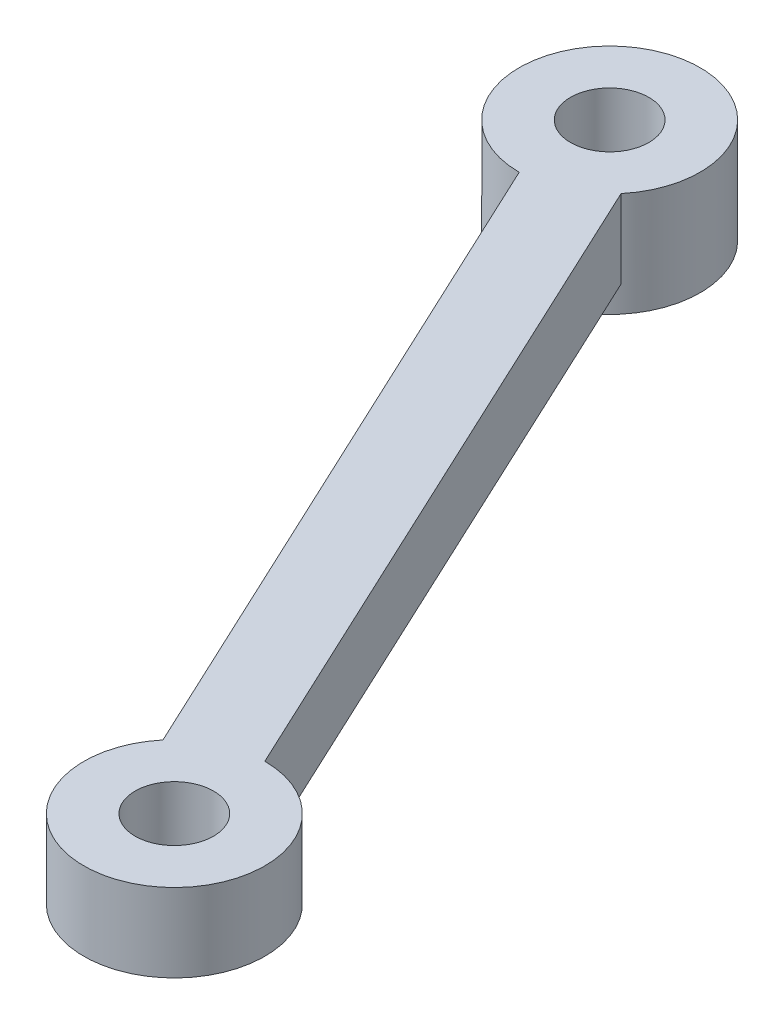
ISO-10303-21;
HEADER;
FILE_DESCRIPTION(('STEP AP214'),'2;1');
FILE_NAME('part.step','',(''),(''),'','','');
FILE_SCHEMA(('AUTOMOTIVE_DESIGN { 1 0 10303 214 1 1 1 1 }'));
ENDSEC;
DATA;
#1=APPLICATION_CONTEXT('core data for automotive mechanical design processes');
#2=APPLICATION_PROTOCOL_DEFINITION('international standard','automotive_design',2000,#1);
#3=PRODUCT_CONTEXT('',#1,'mechanical');
#4=PRODUCT('Part','Part','',(#3));
#5=PRODUCT_RELATED_PRODUCT_CATEGORY('part','',(#4));
#6=PRODUCT_DEFINITION_FORMATION('','',#4);
#7=PRODUCT_DEFINITION_CONTEXT('part definition',#1,'design');
#8=PRODUCT_DEFINITION('design','',#6,#7);
#9=PRODUCT_DEFINITION_SHAPE('','',#8);
#10=(LENGTH_UNIT() NAMED_UNIT(*) SI_UNIT(.MILLI.,.METRE.));
#11=(NAMED_UNIT(*) PLANE_ANGLE_UNIT() SI_UNIT($,.RADIAN.));
#12=(NAMED_UNIT(*) SI_UNIT($,.STERADIAN.) SOLID_ANGLE_UNIT());
#13=UNCERTAINTY_MEASURE_WITH_UNIT(LENGTH_MEASURE(1.E-05),#10,'distance_accuracy_value','');
#14=(GEOMETRIC_REPRESENTATION_CONTEXT(3) GLOBAL_UNCERTAINTY_ASSIGNED_CONTEXT((#13)) GLOBAL_UNIT_ASSIGNED_CONTEXT((#10,
#11,#12)) REPRESENTATION_CONTEXT('',''));
#15=CARTESIAN_POINT('',(0.,0.,0.));
#16=DIRECTION('',(0.,0.,1.));
#17=DIRECTION('',(1.,0.,0.));
#18=AXIS2_PLACEMENT_3D('',#15,#16,#17);
#19=CARTESIAN_POINT('',(0.,27.,-88.));
#20=DIRECTION('',(0.,-1.,0.));
#21=DIRECTION('',(-0.423940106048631,0.,-0.905690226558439));
#22=AXIS2_PLACEMENT_3D('',#19,#20,#21);
#23=PLANE('',#22);
#24=CARTESIAN_POINT('',(22.,27.,-41.));
#25=DIRECTION('',(0.,-1.,0.));
#26=DIRECTION('',(0.,0.,-1.));
#27=AXIS2_PLACEMENT_3D('',#24,#25,#26);
#28=CIRCLE('',#27,2.25);
#29=CARTESIAN_POINT('',(22.,27.,-43.25));
#30=VERTEX_POINT('',#29);
#31=EDGE_CURVE('E96',#30,#30,#28,.T.);
#32=ORIENTED_EDGE('',*,*,#31,.F.);
#33=EDGE_LOOP('',(#32));
#34=FACE_BOUND('',#33,.T.);
#35=DIRECTION('',(0.423940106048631,0.,0.905690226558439));
#36=VECTOR('',#35,1.);
#37=CARTESIAN_POINT('',(1.99251849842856,27.,-88.932668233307));
#38=LINE('',#37,#36);
#39=CARTESIAN_POINT('',(3.98999183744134,27.,-84.6653388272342));
#40=VERTEX_POINT('',#39);
#41=CARTESIAN_POINT('',(21.9950451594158,27.,-46.1999976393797));
#42=VERTEX_POINT('',#41);
#43=EDGE_CURVE('E63',#40,#42,#38,.T.);
#44=ORIENTED_EDGE('',*,*,#43,.T.);
#45=CARTESIAN_POINT('',(22.,27.,-41.));
#46=DIRECTION('',(0.,1.,0.));
#47=DIRECTION('',(0.,0.,1.));
#48=AXIS2_PLACEMENT_3D('',#45,#46,#47);
#49=CIRCLE('',#48,5.2);
#50=CARTESIAN_POINT('',(18.0100081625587,27.,-44.3346611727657));
#51=VERTEX_POINT('',#50);
#52=EDGE_CURVE('E71',#51,#42,#49,.T.);
#53=ORIENTED_EDGE('',*,*,#52,.F.);
#54=DIRECTION('',(0.423940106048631,0.,0.905690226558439));
#55=VECTOR('',#54,1.);
#56=CARTESIAN_POINT('',(-1.99251849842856,27.,-87.067331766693));
#57=LINE('',#56,#55);
#58=CARTESIAN_POINT('',(0.00495484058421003,27.,-82.8000023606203));
#59=VERTEX_POINT('',#58);
#60=EDGE_CURVE('E32',#59,#51,#57,.T.);
#61=ORIENTED_EDGE('',*,*,#60,.F.);
#62=CARTESIAN_POINT('',(0.,27.,-88.));
#63=DIRECTION('',(0.,-1.,0.));
#64=DIRECTION('',(0.,0.,-1.));
#65=AXIS2_PLACEMENT_3D('',#62,#63,#64);
#66=CIRCLE('',#65,5.2);
#67=EDGE_CURVE('E83',#40,#59,#66,.T.);
#68=ORIENTED_EDGE('',*,*,#67,.F.);
#69=EDGE_LOOP('',(#44,#53,#61,#68));
#70=FACE_BOUND('',#69,.T.);
#71=ADVANCED_FACE('F16',(#34,#70),#23,.T.);
#72=CARTESIAN_POINT('',(-1.99251849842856,29.25,-87.067331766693));
#73=DIRECTION('',(-0.905690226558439,0.,0.423940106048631));
#74=DIRECTION('',(0.423940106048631,0.,0.905690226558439));
#75=AXIS2_PLACEMENT_3D('',#72,#73,#74);
#76=PLANE('',#75);
#77=DIRECTION('',(0.,1.,0.));
#78=VECTOR('',#77,1.);
#79=CARTESIAN_POINT('',(18.0100081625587,27.,-44.3346611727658));
#80=LINE('',#79,#78);
#81=CARTESIAN_POINT('',(18.0100081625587,31.5,-44.3346611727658));
#82=VERTEX_POINT('',#81);
#83=EDGE_CURVE('E38',#82,#51,#80,.F.);
#84=ORIENTED_EDGE('',*,*,#83,.F.);
#85=DIRECTION('',(0.423940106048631,0.,0.905690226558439));
#86=VECTOR('',#85,1.);
#87=CARTESIAN_POINT('',(-1.99251849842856,31.5,-87.067331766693));
#88=LINE('',#87,#86);
#89=CARTESIAN_POINT('',(0.00495484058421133,31.5,-82.8000023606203));
#90=VERTEX_POINT('',#89);
#91=EDGE_CURVE('E64',#90,#82,#88,.T.);
#92=ORIENTED_EDGE('',*,*,#91,.F.);
#93=DIRECTION('',(0.,1.,0.));
#94=VECTOR('',#93,1.);
#95=CARTESIAN_POINT('',(0.00495484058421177,25.5,-82.8000023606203));
#96=LINE('',#95,#94);
#97=EDGE_CURVE('E86',#59,#90,#96,.T.);
#98=ORIENTED_EDGE('',*,*,#97,.F.);
#99=ORIENTED_EDGE('',*,*,#60,.T.);
#100=EDGE_LOOP('',(#84,#92,#98,#99));
#101=FACE_BOUND('',#100,.T.);
#102=ADVANCED_FACE('F112',(#101),#76,.T.);
#103=CARTESIAN_POINT('',(0.,31.5,-88.));
#104=DIRECTION('',(0.,1.,0.));
#105=DIRECTION('',(0.423940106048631,0.,0.905690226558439));
#106=AXIS2_PLACEMENT_3D('',#103,#104,#105);
#107=PLANE('',#106);
#108=CARTESIAN_POINT('',(22.,31.5,-41.));
#109=DIRECTION('',(0.,1.,0.));
#110=DIRECTION('',(0.,0.,1.));
#111=AXIS2_PLACEMENT_3D('',#108,#109,#110);
#112=CIRCLE('',#111,2.25);
#113=CARTESIAN_POINT('',(22.,31.5,-38.75));
#114=VERTEX_POINT('',#113);
#115=EDGE_CURVE('E19',#114,#114,#112,.T.);
#116=ORIENTED_EDGE('',*,*,#115,.F.);
#117=EDGE_LOOP('',(#116));
#118=FACE_BOUND('',#117,.T.);
#119=CARTESIAN_POINT('',(0.,31.5,-88.));
#120=DIRECTION('',(0.,1.,0.));
#121=DIRECTION('',(0.,0.,1.));
#122=AXIS2_PLACEMENT_3D('',#119,#120,#121);
#123=CIRCLE('',#122,2.25);
#124=CARTESIAN_POINT('',(0.,31.5,-85.75));
#125=VERTEX_POINT('',#124);
#126=EDGE_CURVE('E80',#125,#125,#123,.T.);
#127=ORIENTED_EDGE('',*,*,#126,.F.);
#128=EDGE_LOOP('',(#127));
#129=FACE_BOUND('',#128,.T.);
#130=ORIENTED_EDGE('',*,*,#91,.T.);
#131=CARTESIAN_POINT('',(22.,31.5,-41.));
#132=DIRECTION('',(0.,-1.,0.));
#133=DIRECTION('',(0.,0.,-1.));
#134=AXIS2_PLACEMENT_3D('',#131,#132,#133);
#135=CIRCLE('',#134,5.2);
#136=CARTESIAN_POINT('',(21.9950451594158,31.5,-46.1999976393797));
#137=VERTEX_POINT('',#136);
#138=EDGE_CURVE('E69',#137,#82,#135,.T.);
#139=ORIENTED_EDGE('',*,*,#138,.F.);
#140=DIRECTION('',(0.423940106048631,0.,0.905690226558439));
#141=VECTOR('',#140,1.);
#142=CARTESIAN_POINT('',(1.99251849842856,31.5,-88.932668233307));
#143=LINE('',#142,#141);
#144=CARTESIAN_POINT('',(3.98999183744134,31.5,-84.6653388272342));
#145=VERTEX_POINT('',#144);
#146=EDGE_CURVE('E54',#145,#137,#143,.T.);
#147=ORIENTED_EDGE('',*,*,#146,.F.);
#148=CARTESIAN_POINT('',(0.,31.5,-88.));
#149=DIRECTION('',(0.,-1.,0.));
#150=DIRECTION('',(0.,0.,-1.));
#151=AXIS2_PLACEMENT_3D('',#148,#149,#150);
#152=CIRCLE('',#151,5.2);
#153=EDGE_CURVE('E84',#90,#145,#152,.T.);
#154=ORIENTED_EDGE('',*,*,#153,.F.);
#155=EDGE_LOOP('',(#130,#139,#147,#154));
#156=FACE_BOUND('',#155,.T.);
#157=ADVANCED_FACE('F73',(#118,#129,#156),#107,.T.);
#158=CARTESIAN_POINT('',(1.99251849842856,29.25,-88.932668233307));
#159=DIRECTION('',(0.905690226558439,0.,-0.423940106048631));
#160=DIRECTION('',(-0.423940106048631,0.,-0.905690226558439));
#161=AXIS2_PLACEMENT_3D('',#158,#159,#160);
#162=PLANE('',#161);
#163=DIRECTION('',(0.,1.,0.));
#164=VECTOR('',#163,1.);
#165=CARTESIAN_POINT('',(21.9950451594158,27.,-46.1999976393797));
#166=LINE('',#165,#164);
#167=EDGE_CURVE('E10',#42,#137,#166,.T.);
#168=ORIENTED_EDGE('',*,*,#167,.F.);
#169=ORIENTED_EDGE('',*,*,#43,.F.);
#170=DIRECTION('',(0.,1.,0.));
#171=VECTOR('',#170,1.);
#172=CARTESIAN_POINT('',(3.98999183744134,25.5,-84.6653388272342));
#173=LINE('',#172,#171);
#174=EDGE_CURVE('E24',#145,#40,#173,.F.);
#175=ORIENTED_EDGE('',*,*,#174,.F.);
#176=ORIENTED_EDGE('',*,*,#146,.T.);
#177=EDGE_LOOP('',(#168,#169,#175,#176));
#178=FACE_BOUND('',#177,.T.);
#179=ADVANCED_FACE('F57',(#178),#162,.T.);
#180=CARTESIAN_POINT('',(0.,25.5,-88.));
#181=DIRECTION('',(0.,-1.,0.));
#182=DIRECTION('',(0.,0.,-1.));
#183=AXIS2_PLACEMENT_3D('',#180,#181,#182);
#184=PLANE('',#183);
#185=CARTESIAN_POINT('',(0.,25.5,-88.));
#186=DIRECTION('',(0.,-1.,0.));
#187=DIRECTION('',(0.,0.,-1.));
#188=AXIS2_PLACEMENT_3D('',#185,#186,#187);
#189=CIRCLE('',#188,2.25);
#190=CARTESIAN_POINT('',(0.,25.5,-90.25));
#191=VERTEX_POINT('',#190);
#192=EDGE_CURVE('E94',#191,#191,#189,.T.);
#193=ORIENTED_EDGE('',*,*,#192,.F.);
#194=EDGE_LOOP('',(#193));
#195=FACE_BOUND('',#194,.T.);
#196=CARTESIAN_POINT('',(0.,25.5,-88.));
#197=DIRECTION('',(0.,1.,0.));
#198=DIRECTION('',(0.,0.,1.));
#199=AXIS2_PLACEMENT_3D('',#196,#197,#198);
#200=CIRCLE('',#199,5.2);
#201=CARTESIAN_POINT('',(0.,25.5,-82.8));
#202=VERTEX_POINT('',#201);
#203=EDGE_CURVE('E74',#202,#202,#200,.T.);
#204=ORIENTED_EDGE('',*,*,#203,.F.);
#205=EDGE_LOOP('',(#204));
#206=FACE_BOUND('',#205,.T.);
#207=ADVANCED_FACE('F137',(#195,#206),#184,.T.);
#208=CARTESIAN_POINT('',(0.,25.5,-88.));
#209=DIRECTION('',(0.,1.,0.));
#210=DIRECTION('',(0.,0.,1.));
#211=AXIS2_PLACEMENT_3D('',#208,#209,#210);
#212=CYLINDRICAL_SURFACE('',#211,5.2);
#213=ORIENTED_EDGE('',*,*,#67,.T.);
#214=ORIENTED_EDGE('',*,*,#97,.T.);
#215=ORIENTED_EDGE('',*,*,#153,.T.);
#216=ORIENTED_EDGE('',*,*,#174,.T.);
#217=EDGE_LOOP('',(#213,#214,#215,#216));
#218=FACE_BOUND('',#217,.T.);
#219=ORIENTED_EDGE('',*,*,#203,.T.);
#220=EDGE_LOOP('',(#219));
#221=FACE_BOUND('',#220,.T.);
#222=ADVANCED_FACE('F122',(#218,#221),#212,.T.);
#223=CARTESIAN_POINT('',(22.,27.,-41.));
#224=DIRECTION('',(0.,1.,0.));
#225=DIRECTION('',(0.,0.,1.));
#226=AXIS2_PLACEMENT_3D('',#223,#224,#225);
#227=CYLINDRICAL_SURFACE('',#226,5.2);
#228=ORIENTED_EDGE('',*,*,#138,.T.);
#229=ORIENTED_EDGE('',*,*,#83,.T.);
#230=ORIENTED_EDGE('',*,*,#52,.T.);
#231=ORIENTED_EDGE('',*,*,#167,.T.);
#232=EDGE_LOOP('',(#228,#229,#230,#231));
#233=FACE_BOUND('',#232,.T.);
#234=ADVANCED_FACE('F67',(#233),#227,.T.);
#235=CARTESIAN_POINT('',(0.,25.35,-88.));
#236=DIRECTION('',(0.,1.,0.));
#237=DIRECTION('',(0.,0.,1.));
#238=AXIS2_PLACEMENT_3D('',#235,#236,#237);
#239=CYLINDRICAL_SURFACE('',#238,2.25);
#240=ORIENTED_EDGE('',*,*,#126,.T.);
#241=EDGE_LOOP('',(#240));
#242=FACE_BOUND('',#241,.T.);
#243=ORIENTED_EDGE('',*,*,#192,.T.);
#244=EDGE_LOOP('',(#243));
#245=FACE_BOUND('',#244,.T.);
#246=ADVANCED_FACE('F113',(#242,#245),#239,.F.);
#247=CARTESIAN_POINT('',(22.,26.85,-41.));
#248=DIRECTION('',(0.,1.,0.));
#249=DIRECTION('',(0.,0.,1.));
#250=AXIS2_PLACEMENT_3D('',#247,#248,#249);
#251=CYLINDRICAL_SURFACE('',#250,2.25);
#252=ORIENTED_EDGE('',*,*,#31,.T.);
#253=EDGE_LOOP('',(#252));
#254=FACE_BOUND('',#253,.T.);
#255=ORIENTED_EDGE('',*,*,#115,.T.);
#256=EDGE_LOOP('',(#255));
#257=FACE_BOUND('',#256,.T.);
#258=ADVANCED_FACE('F110',(#254,#257),#251,.F.);
#259=CLOSED_SHELL('',(#71,#102,#157,#179,#207,#222,#234,#246,#258));
#260=MANIFOLD_SOLID_BREP('B1',#259);
#261=ADVANCED_BREP_SHAPE_REPRESENTATION('',(#18,#260),#14);
#262=SHAPE_DEFINITION_REPRESENTATION(#9,#261);
ENDSEC;
END-ISO-10303-21;
